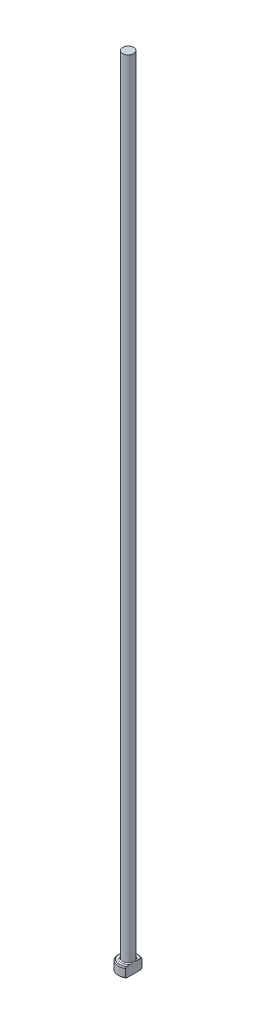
from build123d import *
from build123d.topology import SkipClean

# Parameters (mm, degrees)
CHAMFER1_SIZE = 0.2
FILLET1_R     = 0.2
KEY_DEPTH     = 161.024998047


with BuildPart() as part:
    # Sketch1 → Revolve1 (revolve)
    with BuildSketch(Plane.XY, mode=Mode.PRIVATE) as revolve1_sk:
        Polygon((0, 0), (-2, 0), (-2, 2), (-1.1, 2), (-1.1, 160), (0, 160), align=None)
    revolve(revolve1_sk.sketch.rotate(Axis((0, 259.958771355, 0), (0, -1, 0)), 270), axis=Axis((0, 259.958771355, 0), (0, -1, 0)))

    # Chamfer1
    chamfer1_edges = [part.edges().sort_by_distance(p)[0] for p in [
        (0, 2, -2),
        (0, 0, -2),
    ]]
    chamfer(chamfer1_edges, length=CHAMFER1_SIZE)

    # Fillet1
    fillet1_edges = [part.edges().sort_by_distance(p)[0] for p in [
        (0, 2, -1.1),
    ]]
    fillet(fillet1_edges, radius=FILLET1_R)

    # Sketch2 → KEY (cut, through all)
    with SkipClean():  # the faces are left unmerged after this step: merging them gives an invalid solid
        with BuildSketch(Plane(origin=(0, 0, 0), x_dir=(1, 0, 0), z_dir=(0, 1, 0))):
            with BuildLine():
                Line((1.1, 1.670329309), (1.1, -1.670329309))
                ThreePointArc((1.1, -1.670329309), (2, 0), (1.1, 1.670329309))
            make_face()
        extrude(amount=KEY_DEPTH, mode=Mode.SUBTRACT)


solid = part.part
